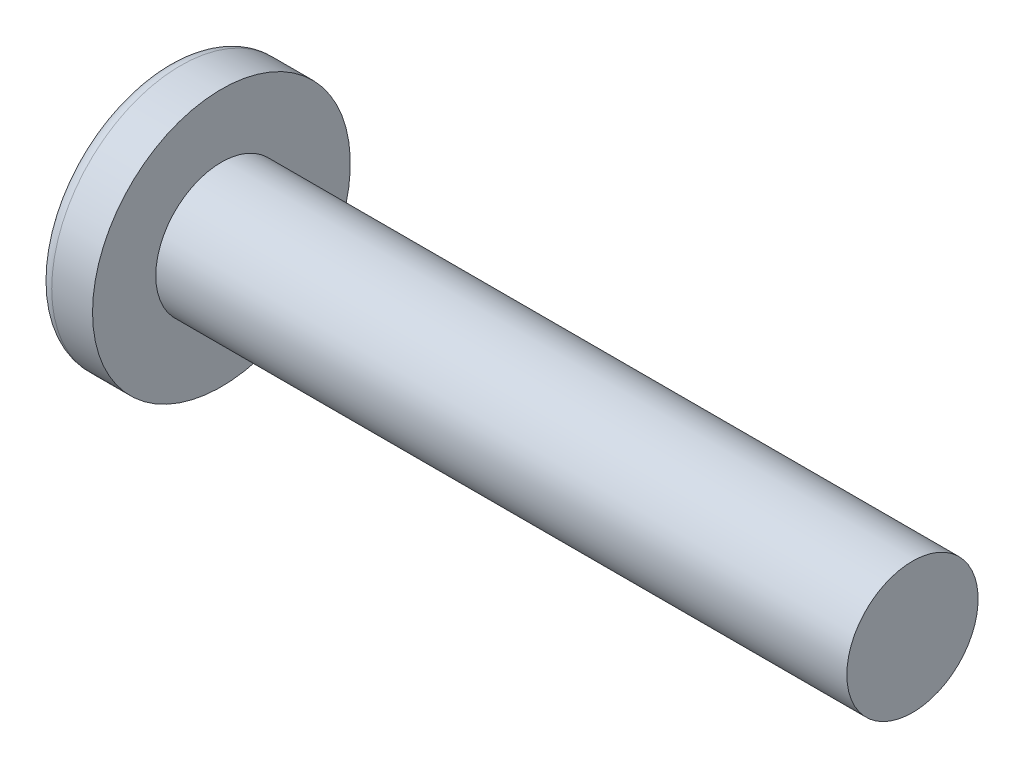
ISO-10303-21;
HEADER;
FILE_DESCRIPTION(('STEP AP214'),'2;1');
FILE_NAME('part.step','',(''),(''),'','','');
FILE_SCHEMA(('AUTOMOTIVE_DESIGN { 1 0 10303 214 1 1 1 1 }'));
ENDSEC;
DATA;
#1=APPLICATION_CONTEXT('core data for automotive mechanical design processes');
#2=APPLICATION_PROTOCOL_DEFINITION('international standard','automotive_design',2000,#1);
#3=PRODUCT_CONTEXT('',#1,'mechanical');
#4=PRODUCT('Part','Part','',(#3));
#5=PRODUCT_RELATED_PRODUCT_CATEGORY('part','',(#4));
#6=PRODUCT_DEFINITION_FORMATION('','',#4);
#7=PRODUCT_DEFINITION_CONTEXT('part definition',#1,'design');
#8=PRODUCT_DEFINITION('design','',#6,#7);
#9=PRODUCT_DEFINITION_SHAPE('','',#8);
#10=(LENGTH_UNIT() NAMED_UNIT(*) SI_UNIT(.MILLI.,.METRE.));
#11=(NAMED_UNIT(*) PLANE_ANGLE_UNIT() SI_UNIT($,.RADIAN.));
#12=(NAMED_UNIT(*) SI_UNIT($,.STERADIAN.) SOLID_ANGLE_UNIT());
#13=UNCERTAINTY_MEASURE_WITH_UNIT(LENGTH_MEASURE(1.E-05),#10,'distance_accuracy_value','');
#14=(GEOMETRIC_REPRESENTATION_CONTEXT(3) GLOBAL_UNCERTAINTY_ASSIGNED_CONTEXT((#13)) GLOBAL_UNIT_ASSIGNED_CONTEXT((#10,
#11,#12)) REPRESENTATION_CONTEXT('',''));
#15=CARTESIAN_POINT('',(0.,0.,0.));
#16=DIRECTION('',(0.,0.,1.));
#17=DIRECTION('',(1.,0.,0.));
#18=AXIS2_PLACEMENT_3D('',#15,#16,#17);
#19=CARTESIAN_POINT('',(7.7216,0.,0.));
#20=DIRECTION('',(-1.,0.,0.));
#21=DIRECTION('',(0.,1.,0.));
#22=AXIS2_PLACEMENT_3D('',#19,#20,#21);
#23=SPHERICAL_SURFACE('',#22,7.7216);
#24=CARTESIAN_POINT('',(1.46619704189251,0.,0.));
#25=DIRECTION('',(-1.,0.,0.));
#26=DIRECTION('',(0.,0.,1.));
#27=AXIS2_PLACEMENT_3D('',#24,#25,#26);
#28=CIRCLE('',#27,4.52692394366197);
#29=CARTESIAN_POINT('',(1.46619704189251,0.,4.52692394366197));
#30=VERTEX_POINT('',#29);
#31=EDGE_CURVE('E150',#30,#30,#28,.T.);
#32=ORIENTED_EDGE('',*,*,#31,.T.);
#33=EDGE_LOOP('',(#32));
#34=FACE_BOUND('',#33,.T.);
#35=CARTESIAN_POINT('',(7.71626836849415,-0.0635159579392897,0.));
#36=DIRECTION('',(-0.0836474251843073,-0.996495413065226,0.));
#37=DIRECTION('',(0.996495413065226,-0.0836474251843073,0.));
#38=AXIS2_PLACEMENT_3D('',#35,#36,#37);
#39=CIRCLE('',#38,7.72133692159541);
#40=CARTESIAN_POINT('',(0.492297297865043,0.542875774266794,2.65811491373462));
#41=VERTEX_POINT('',#40);
#42=CARTESIAN_POINT('',(0.0437691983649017,0.580525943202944,0.580525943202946));
#43=VERTEX_POINT('',#42);
#44=EDGE_CURVE('E181',#41,#43,#39,.T.);
#45=ORIENTED_EDGE('',*,*,#44,.F.);
#46=CARTESIAN_POINT('',(6.22874657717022,0.,-1.88498542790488));
#47=DIRECTION('',(0.620849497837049,0.,0.783929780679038));
#48=DIRECTION('',(0.783929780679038,0.,-0.620849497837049));
#49=AXIS2_PLACEMENT_3D('',#46,#47,#48);
#50=CIRCLE('',#49,7.33766482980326);
#51=CARTESIAN_POINT('',(0.492297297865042,-0.542875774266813,2.65811491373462));
#52=VERTEX_POINT('',#51);
#53=EDGE_CURVE('E146',#41,#52,#50,.T.);
#54=ORIENTED_EDGE('',*,*,#53,.T.);
#55=CARTESIAN_POINT('',(7.71626836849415,0.0635159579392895,0.));
#56=DIRECTION('',(-0.0836474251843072,0.996495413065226,0.));
#57=DIRECTION('',(-0.996495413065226,-0.0836474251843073,0.));
#58=AXIS2_PLACEMENT_3D('',#55,#56,#57);
#59=CIRCLE('',#58,7.72133692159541);
#60=CARTESIAN_POINT('',(0.0437691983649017,-0.580525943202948,0.580525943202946));
#61=VERTEX_POINT('',#60);
#62=EDGE_CURVE('E102',#61,#52,#59,.T.);
#63=ORIENTED_EDGE('',*,*,#62,.F.);
#64=CARTESIAN_POINT('',(7.71626836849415,0.,-0.0635159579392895));
#65=DIRECTION('',(-0.0836474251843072,0.,-0.996495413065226));
#66=DIRECTION('',(-0.996495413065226,0.,0.0836474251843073));
#67=AXIS2_PLACEMENT_3D('',#64,#65,#66);
#68=CIRCLE('',#67,7.72133692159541);
#69=CARTESIAN_POINT('',(0.492297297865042,-2.65811491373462,0.542875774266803));
#70=VERTEX_POINT('',#69);
#71=EDGE_CURVE('E127',#70,#61,#68,.T.);
#72=ORIENTED_EDGE('',*,*,#71,.F.);
#73=CARTESIAN_POINT('',(6.22874657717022,1.88498542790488,0.));
#74=DIRECTION('',(0.620849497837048,-0.783929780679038,0.));
#75=DIRECTION('',(0.783929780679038,0.620849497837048,0.));
#76=AXIS2_PLACEMENT_3D('',#73,#74,#75);
#77=CIRCLE('',#76,7.33766482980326);
#78=CARTESIAN_POINT('',(0.492297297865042,-2.65811491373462,-0.542875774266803));
#79=VERTEX_POINT('',#78);
#80=EDGE_CURVE('E135',#70,#79,#77,.T.);
#81=ORIENTED_EDGE('',*,*,#80,.T.);
#82=CARTESIAN_POINT('',(7.71626836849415,0.,0.0635159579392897));
#83=DIRECTION('',(-0.0836474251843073,0.,0.996495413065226));
#84=DIRECTION('',(0.996495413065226,0.,0.0836474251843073));
#85=AXIS2_PLACEMENT_3D('',#82,#83,#84);
#86=CIRCLE('',#85,7.72133692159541);
#87=CARTESIAN_POINT('',(0.0437691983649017,-0.580525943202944,-0.580525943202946));
#88=VERTEX_POINT('',#87);
#89=EDGE_CURVE('E45',#88,#79,#86,.T.);
#90=ORIENTED_EDGE('',*,*,#89,.F.);
#91=CARTESIAN_POINT('',(0.492297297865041,-0.542875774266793,-2.65811491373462));
#92=VERTEX_POINT('',#91);
#93=EDGE_CURVE('E188',#92,#88,#59,.T.);
#94=ORIENTED_EDGE('',*,*,#93,.F.);
#95=CARTESIAN_POINT('',(6.22874657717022,0.,1.88498542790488));
#96=DIRECTION('',(0.620849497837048,0.,-0.783929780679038));
#97=DIRECTION('',(-0.783929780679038,0.,-0.620849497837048));
#98=AXIS2_PLACEMENT_3D('',#95,#96,#97);
#99=CIRCLE('',#98,7.33766482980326);
#100=CARTESIAN_POINT('',(0.492297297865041,0.542875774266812,-2.65811491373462));
#101=VERTEX_POINT('',#100);
#102=EDGE_CURVE('E128',#92,#101,#99,.T.);
#103=ORIENTED_EDGE('',*,*,#102,.T.);
#104=CARTESIAN_POINT('',(0.0437691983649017,0.580525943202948,-0.580525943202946));
#105=VERTEX_POINT('',#104);
#106=EDGE_CURVE('E176',#105,#101,#39,.T.);
#107=ORIENTED_EDGE('',*,*,#106,.F.);
#108=CARTESIAN_POINT('',(0.492297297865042,2.65811491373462,-0.542875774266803));
#109=VERTEX_POINT('',#108);
#110=EDGE_CURVE('E38',#109,#105,#86,.T.);
#111=ORIENTED_EDGE('',*,*,#110,.F.);
#112=CARTESIAN_POINT('',(6.22874657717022,-1.88498542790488,0.));
#113=DIRECTION('',(0.620849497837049,0.783929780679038,0.));
#114=DIRECTION('',(-0.783929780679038,0.620849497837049,0.));
#115=AXIS2_PLACEMENT_3D('',#112,#113,#114);
#116=CIRCLE('',#115,7.33766482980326);
#117=CARTESIAN_POINT('',(0.492297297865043,2.65811491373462,0.542875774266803));
#118=VERTEX_POINT('',#117);
#119=EDGE_CURVE('E11',#109,#118,#116,.T.);
#120=ORIENTED_EDGE('',*,*,#119,.T.);
#121=EDGE_CURVE('E164',#43,#118,#68,.T.);
#122=ORIENTED_EDGE('',*,*,#121,.F.);
#123=EDGE_LOOP('',(#45,#54,#63,#72,#81,#90,#94,#103,#107,#111,#120,#122));
#124=FACE_BOUND('',#123,.T.);
#125=ADVANCED_FACE('F30',(#34,#124),#23,.T.);
#126=CARTESIAN_POINT('',(3.8486267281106,0.,-0.261140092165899));
#127=DIRECTION('',(-0.0836474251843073,0.,0.996495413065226));
#128=DIRECTION('',(0.996495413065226,0.,0.0836474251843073));
#129=AXIS2_PLACEMENT_3D('',#126,#127,#128);
#130=PLANE('',#129);
#131=ORIENTED_EDGE('',*,*,#110,.T.);
#132=DIRECTION('',(0.993027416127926,-0.0833563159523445,0.0833563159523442));
#133=VECTOR('',#132,1.);
#134=CARTESIAN_POINT('',(3.87024262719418,0.259325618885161,-0.25932561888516));
#135=LINE('',#134,#133);
#136=CARTESIAN_POINT('',(3.4798,0.292100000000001,-0.292099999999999));
#137=VERTEX_POINT('',#136);
#138=EDGE_CURVE('E170',#105,#137,#135,.T.);
#139=ORIENTED_EDGE('',*,*,#138,.T.);
#140=DIRECTION('',(0.782237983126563,-0.619509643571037,0.0656623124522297));
#141=VECTOR('',#140,1.);
#142=CARTESIAN_POINT('',(0.,3.048,-0.5842));
#143=LINE('',#142,#141);
#144=EDGE_CURVE('E151',#109,#137,#143,.T.);
#145=ORIENTED_EDGE('',*,*,#144,.F.);
#146=EDGE_LOOP('',(#131,#139,#145));
#147=FACE_BOUND('',#146,.T.);
#148=ADVANCED_FACE('F169',(#147),#130,.T.);
#149=DIRECTION('',(0.782237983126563,0.619509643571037,0.0656623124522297));
#150=VECTOR('',#149,1.);
#151=CARTESIAN_POINT('',(0.,-3.048,-0.5842));
#152=LINE('',#151,#150);
#153=CARTESIAN_POINT('',(3.4798,-0.2921,-0.2921));
#154=VERTEX_POINT('',#153);
#155=EDGE_CURVE('E136',#79,#154,#152,.T.);
#156=ORIENTED_EDGE('',*,*,#155,.T.);
#157=DIRECTION('',(-0.993027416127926,-0.0833563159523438,-0.0833563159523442));
#158=VECTOR('',#157,1.);
#159=CARTESIAN_POINT('',(3.87024262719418,-0.259325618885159,-0.25932561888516));
#160=LINE('',#159,#158);
#161=EDGE_CURVE('E191',#154,#88,#160,.T.);
#162=ORIENTED_EDGE('',*,*,#161,.T.);
#163=ORIENTED_EDGE('',*,*,#89,.T.);
#164=EDGE_LOOP('',(#156,#162,#163));
#165=FACE_BOUND('',#164,.T.);
#166=ADVANCED_FACE('F206',(#165),#130,.T.);
#167=CARTESIAN_POINT('',(3.8486267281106,0.,0.261140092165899));
#168=DIRECTION('',(-0.0836474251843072,0.,-0.996495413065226));
#169=DIRECTION('',(-0.996495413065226,0.,0.0836474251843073));
#170=AXIS2_PLACEMENT_3D('',#167,#168,#169);
#171=PLANE('',#170);
#172=DIRECTION('',(0.782237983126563,-0.619509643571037,-0.0656623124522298));
#173=VECTOR('',#172,1.);
#174=CARTESIAN_POINT('',(0.,3.048,0.5842));
#175=LINE('',#174,#173);
#176=CARTESIAN_POINT('',(3.4798,0.2921,0.2921));
#177=VERTEX_POINT('',#176);
#178=EDGE_CURVE('E207',#118,#177,#175,.T.);
#179=ORIENTED_EDGE('',*,*,#178,.T.);
#180=DIRECTION('',(-0.993027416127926,0.0833563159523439,0.0833563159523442));
#181=VECTOR('',#180,1.);
#182=CARTESIAN_POINT('',(3.87024262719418,0.259325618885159,0.25932561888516));
#183=LINE('',#182,#181);
#184=EDGE_CURVE('E185',#177,#43,#183,.T.);
#185=ORIENTED_EDGE('',*,*,#184,.T.);
#186=ORIENTED_EDGE('',*,*,#121,.T.);
#187=EDGE_LOOP('',(#179,#185,#186));
#188=FACE_BOUND('',#187,.T.);
#189=ADVANCED_FACE('F211',(#188),#171,.T.);
#190=ORIENTED_EDGE('',*,*,#71,.T.);
#191=DIRECTION('',(0.993027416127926,0.0833563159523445,-0.0833563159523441));
#192=VECTOR('',#191,1.);
#193=CARTESIAN_POINT('',(3.87024262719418,-0.259325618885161,0.25932561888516));
#194=LINE('',#193,#192);
#195=CARTESIAN_POINT('',(3.4798,-0.292100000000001,0.292099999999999));
#196=VERTEX_POINT('',#195);
#197=EDGE_CURVE('E100',#61,#196,#194,.T.);
#198=ORIENTED_EDGE('',*,*,#197,.T.);
#199=DIRECTION('',(0.782237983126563,0.619509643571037,-0.0656623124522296));
#200=VECTOR('',#199,1.);
#201=CARTESIAN_POINT('',(0.,-3.048,0.584199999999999));
#202=LINE('',#201,#200);
#203=EDGE_CURVE('E125',#70,#196,#202,.T.);
#204=ORIENTED_EDGE('',*,*,#203,.F.);
#205=EDGE_LOOP('',(#190,#198,#204));
#206=FACE_BOUND('',#205,.T.);
#207=ADVANCED_FACE('F124',(#206),#171,.T.);
#208=CARTESIAN_POINT('',(-25.4,0.,0.));
#209=DIRECTION('',(-1.,0.,0.));
#210=DIRECTION('',(0.,0.,1.));
#211=AXIS2_PLACEMENT_3D('',#208,#209,#210);
#212=CYLINDRICAL_SURFACE('',#211,2.413);
#213=CARTESIAN_POINT('',(28.7782,0.,0.));
#214=DIRECTION('',(-1.,0.,0.));
#215=DIRECTION('',(0.,0.,1.));
#216=AXIS2_PLACEMENT_3D('',#213,#214,#215);
#217=CIRCLE('',#216,2.413);
#218=CARTESIAN_POINT('',(28.7782,0.,2.413));
#219=VERTEX_POINT('',#218);
#220=EDGE_CURVE('E147',#219,#219,#217,.T.);
#221=ORIENTED_EDGE('',*,*,#220,.T.);
#222=EDGE_LOOP('',(#221));
#223=FACE_BOUND('',#222,.T.);
#224=CARTESIAN_POINT('',(3.3782,0.,0.));
#225=DIRECTION('',(-1.,0.,0.));
#226=DIRECTION('',(0.,0.,1.));
#227=AXIS2_PLACEMENT_3D('',#224,#225,#226);
#228=CIRCLE('',#227,2.413);
#229=CARTESIAN_POINT('',(3.3782,0.,2.413));
#230=VERTEX_POINT('',#229);
#231=EDGE_CURVE('E160',#230,#230,#228,.T.);
#232=ORIENTED_EDGE('',*,*,#231,.F.);
#233=EDGE_LOOP('',(#232));
#234=FACE_BOUND('',#233,.T.);
#235=ADVANCED_FACE('F32',(#223,#234),#212,.T.);
#236=CARTESIAN_POINT('',(3.3782,2.413,0.));
#237=DIRECTION('',(-1.,0.,0.));
#238=DIRECTION('',(0.,0.,1.));
#239=AXIS2_PLACEMENT_3D('',#236,#237,#238);
#240=PLANE('',#239);
#241=CARTESIAN_POINT('',(3.3782,0.,0.));
#242=DIRECTION('',(-1.,0.,0.));
#243=DIRECTION('',(0.,0.,1.));
#244=AXIS2_PLACEMENT_3D('',#241,#242,#243);
#245=CIRCLE('',#244,4.7371);
#246=CARTESIAN_POINT('',(3.3782,0.,4.7371));
#247=VERTEX_POINT('',#246);
#248=EDGE_CURVE('E157',#247,#247,#245,.T.);
#249=ORIENTED_EDGE('',*,*,#248,.F.);
#250=EDGE_LOOP('',(#249));
#251=FACE_BOUND('',#250,.T.);
#252=ORIENTED_EDGE('',*,*,#231,.T.);
#253=EDGE_LOOP('',(#252));
#254=FACE_BOUND('',#253,.T.);
#255=ADVANCED_FACE('F239',(#251,#254),#240,.F.);
#256=CARTESIAN_POINT('',(-25.4,0.,0.));
#257=DIRECTION('',(-1.,0.,0.));
#258=DIRECTION('',(0.,0.,1.));
#259=AXIS2_PLACEMENT_3D('',#256,#257,#258);
#260=CYLINDRICAL_SURFACE('',#259,4.7371);
#261=ORIENTED_EDGE('',*,*,#248,.T.);
#262=EDGE_LOOP('',(#261));
#263=FACE_BOUND('',#262,.T.);
#264=CARTESIAN_POINT('',(1.87773671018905,0.,0.));
#265=DIRECTION('',(-1.,0.,0.));
#266=DIRECTION('',(0.,0.,1.));
#267=AXIS2_PLACEMENT_3D('',#264,#265,#266);
#268=CIRCLE('',#267,4.7371);
#269=CARTESIAN_POINT('',(1.87773671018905,0.,4.7371));
#270=VERTEX_POINT('',#269);
#271=EDGE_CURVE('E154',#270,#270,#268,.T.);
#272=ORIENTED_EDGE('',*,*,#271,.F.);
#273=EDGE_LOOP('',(#272));
#274=FACE_BOUND('',#273,.T.);
#275=ADVANCED_FACE('F236',(#263,#274),#260,.T.);
#276=CARTESIAN_POINT('',(1.87773671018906,0.,0.));
#277=DIRECTION('',(-1.,0.,0.));
#278=DIRECTION('',(0.,0.,1.));
#279=AXIS2_PLACEMENT_3D('',#276,#277,#278);
#280=TOROIDAL_SURFACE('',#279,4.2291,0.508);
#281=ORIENTED_EDGE('',*,*,#271,.T.);
#282=EDGE_LOOP('',(#281));
#283=FACE_BOUND('',#282,.T.);
#284=ORIENTED_EDGE('',*,*,#31,.F.);
#285=EDGE_LOOP('',(#284));
#286=FACE_BOUND('',#285,.T.);
#287=ADVANCED_FACE('F233',(#283,#286),#280,.T.);
#288=CARTESIAN_POINT('',(28.7782,2.413,0.));
#289=DIRECTION('',(1.,0.,0.));
#290=DIRECTION('',(0.,0.,-1.));
#291=AXIS2_PLACEMENT_3D('',#288,#289,#290);
#292=PLANE('',#291);
#293=ORIENTED_EDGE('',*,*,#220,.F.);
#294=EDGE_LOOP('',(#293));
#295=FACE_BOUND('',#294,.T.);
#296=ADVANCED_FACE('F231',(#295),#292,.T.);
#297=CARTESIAN_POINT('',(0.,3.048,0.5842));
#298=DIRECTION('',(0.620849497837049,0.783929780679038,0.));
#299=DIRECTION('',(-0.783929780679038,0.620849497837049,0.));
#300=AXIS2_PLACEMENT_3D('',#297,#298,#299);
#301=PLANE('',#300);
#302=ORIENTED_EDGE('',*,*,#144,.T.);
#303=DIRECTION('',(0.,0.,-1.));
#304=VECTOR('',#303,1.);
#305=CARTESIAN_POINT('',(3.4798,0.2921,0.2921));
#306=LINE('',#305,#304);
#307=EDGE_CURVE('E118',#177,#137,#306,.T.);
#308=ORIENTED_EDGE('',*,*,#307,.F.);
#309=ORIENTED_EDGE('',*,*,#178,.F.);
#310=ORIENTED_EDGE('',*,*,#119,.F.);
#311=EDGE_LOOP('',(#302,#308,#309,#310));
#312=FACE_BOUND('',#311,.T.);
#313=ADVANCED_FACE('F210',(#312),#301,.F.);
#314=CARTESIAN_POINT('',(3.4798,-0.2921,-0.2921));
#315=DIRECTION('',(0.620849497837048,-0.783929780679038,0.));
#316=DIRECTION('',(0.783929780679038,0.620849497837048,0.));
#317=AXIS2_PLACEMENT_3D('',#314,#315,#316);
#318=PLANE('',#317);
#319=ORIENTED_EDGE('',*,*,#203,.T.);
#320=DIRECTION('',(0.,0.,1.));
#321=VECTOR('',#320,1.);
#322=CARTESIAN_POINT('',(3.4798,-0.2921,-0.2921));
#323=LINE('',#322,#321);
#324=EDGE_CURVE('E117',#154,#196,#323,.T.);
#325=ORIENTED_EDGE('',*,*,#324,.F.);
#326=ORIENTED_EDGE('',*,*,#155,.F.);
#327=ORIENTED_EDGE('',*,*,#80,.F.);
#328=EDGE_LOOP('',(#319,#325,#326,#327));
#329=FACE_BOUND('',#328,.T.);
#330=ADVANCED_FACE('F132',(#329),#318,.F.);
#331=CARTESIAN_POINT('',(3.4798,0.2921,-0.2921));
#332=DIRECTION('',(-1.,0.,0.));
#333=DIRECTION('',(0.,0.,1.));
#334=AXIS2_PLACEMENT_3D('',#331,#332,#333);
#335=PLANE('',#334);
#336=DIRECTION('',(0.,1.,0.));
#337=VECTOR('',#336,1.);
#338=CARTESIAN_POINT('',(3.4798,-0.2921,-0.2921));
#339=LINE('',#338,#337);
#340=EDGE_CURVE('E140',#154,#137,#339,.T.);
#341=ORIENTED_EDGE('',*,*,#340,.F.);
#342=ORIENTED_EDGE('',*,*,#324,.T.);
#343=DIRECTION('',(0.,-1.,0.));
#344=VECTOR('',#343,1.);
#345=CARTESIAN_POINT('',(3.4798,0.2921,0.2921));
#346=LINE('',#345,#344);
#347=EDGE_CURVE('E109',#177,#196,#346,.T.);
#348=ORIENTED_EDGE('',*,*,#347,.F.);
#349=ORIENTED_EDGE('',*,*,#307,.T.);
#350=EDGE_LOOP('',(#341,#342,#348,#349));
#351=FACE_BOUND('',#350,.T.);
#352=ADVANCED_FACE('F138',(#351),#335,.T.);
#353=CARTESIAN_POINT('',(3.4798,0.292100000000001,-0.292099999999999));
#354=DIRECTION('',(0.620849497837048,0.,-0.783929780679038));
#355=DIRECTION('',(0.783929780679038,0.,0.620849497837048));
#356=AXIS2_PLACEMENT_3D('',#353,#354,#355);
#357=PLANE('',#356);
#358=DIRECTION('',(0.782237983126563,0.0656623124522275,0.619509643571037));
#359=VECTOR('',#358,1.);
#360=CARTESIAN_POINT('',(0.,-0.584199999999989,-3.048));
#361=LINE('',#360,#359);
#362=EDGE_CURVE('E196',#92,#154,#361,.T.);
#363=ORIENTED_EDGE('',*,*,#362,.T.);
#364=ORIENTED_EDGE('',*,*,#340,.T.);
#365=DIRECTION('',(0.782237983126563,-0.0656623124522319,0.619509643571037));
#366=VECTOR('',#365,1.);
#367=CARTESIAN_POINT('',(0.,0.584200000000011,-3.048));
#368=LINE('',#367,#366);
#369=EDGE_CURVE('E106',#101,#137,#368,.T.);
#370=ORIENTED_EDGE('',*,*,#369,.F.);
#371=ORIENTED_EDGE('',*,*,#102,.F.);
#372=EDGE_LOOP('',(#363,#364,#370,#371));
#373=FACE_BOUND('',#372,.T.);
#374=ADVANCED_FACE('F201',(#373),#357,.F.);
#375=CARTESIAN_POINT('',(3.8486267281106,-0.261140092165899,0.));
#376=DIRECTION('',(-0.0836474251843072,0.996495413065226,0.));
#377=DIRECTION('',(-0.996495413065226,-0.0836474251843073,0.));
#378=AXIS2_PLACEMENT_3D('',#375,#376,#377);
#379=PLANE('',#378);
#380=ORIENTED_EDGE('',*,*,#93,.T.);
#381=ORIENTED_EDGE('',*,*,#161,.F.);
#382=ORIENTED_EDGE('',*,*,#362,.F.);
#383=EDGE_LOOP('',(#380,#381,#382));
#384=FACE_BOUND('',#383,.T.);
#385=ADVANCED_FACE('F205',(#384),#379,.T.);
#386=CARTESIAN_POINT('',(3.8486267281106,0.261140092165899,0.));
#387=DIRECTION('',(-0.0836474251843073,-0.996495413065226,0.));
#388=DIRECTION('',(0.996495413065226,-0.0836474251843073,0.));
#389=AXIS2_PLACEMENT_3D('',#386,#387,#388);
#390=PLANE('',#389);
#391=ORIENTED_EDGE('',*,*,#106,.T.);
#392=ORIENTED_EDGE('',*,*,#369,.T.);
#393=ORIENTED_EDGE('',*,*,#138,.F.);
#394=EDGE_LOOP('',(#391,#392,#393));
#395=FACE_BOUND('',#394,.T.);
#396=ADVANCED_FACE('F199',(#395),#390,.T.);
#397=CARTESIAN_POINT('',(0.,-0.584200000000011,3.048));
#398=DIRECTION('',(0.620849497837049,0.,0.783929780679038));
#399=DIRECTION('',(-0.783929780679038,0.,0.620849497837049));
#400=AXIS2_PLACEMENT_3D('',#397,#398,#399);
#401=PLANE('',#400);
#402=DIRECTION('',(0.782237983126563,-0.0656623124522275,-0.619509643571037));
#403=VECTOR('',#402,1.);
#404=CARTESIAN_POINT('',(0.,0.584199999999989,3.048));
#405=LINE('',#404,#403);
#406=EDGE_CURVE('E105',#41,#177,#405,.T.);
#407=ORIENTED_EDGE('',*,*,#406,.T.);
#408=ORIENTED_EDGE('',*,*,#347,.T.);
#409=DIRECTION('',(0.782237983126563,0.0656623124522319,-0.619509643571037));
#410=VECTOR('',#409,1.);
#411=CARTESIAN_POINT('',(0.,-0.584200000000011,3.048));
#412=LINE('',#411,#410);
#413=EDGE_CURVE('E96',#52,#196,#412,.T.);
#414=ORIENTED_EDGE('',*,*,#413,.F.);
#415=ORIENTED_EDGE('',*,*,#53,.F.);
#416=EDGE_LOOP('',(#407,#408,#414,#415));
#417=FACE_BOUND('',#416,.T.);
#418=ADVANCED_FACE('F110',(#417),#401,.F.);
#419=ORIENTED_EDGE('',*,*,#44,.T.);
#420=ORIENTED_EDGE('',*,*,#184,.F.);
#421=ORIENTED_EDGE('',*,*,#406,.F.);
#422=EDGE_LOOP('',(#419,#420,#421));
#423=FACE_BOUND('',#422,.T.);
#424=ADVANCED_FACE('F212',(#423),#390,.T.);
#425=ORIENTED_EDGE('',*,*,#62,.T.);
#426=ORIENTED_EDGE('',*,*,#413,.T.);
#427=ORIENTED_EDGE('',*,*,#197,.F.);
#428=EDGE_LOOP('',(#425,#426,#427));
#429=FACE_BOUND('',#428,.T.);
#430=ADVANCED_FACE('F98',(#429),#379,.T.);
#431=CLOSED_SHELL('',(#125,#148,#166,#189,#207,#235,#255,#275,#287,#296,#313,#330,#352,#374,
#385,#396,#418,#424,#430));
#432=MANIFOLD_SOLID_BREP('B2',#431);
#433=ADVANCED_BREP_SHAPE_REPRESENTATION('',(#18,#432),#14);
#434=SHAPE_DEFINITION_REPRESENTATION(#9,#433);
ENDSEC;
END-ISO-10303-21;
